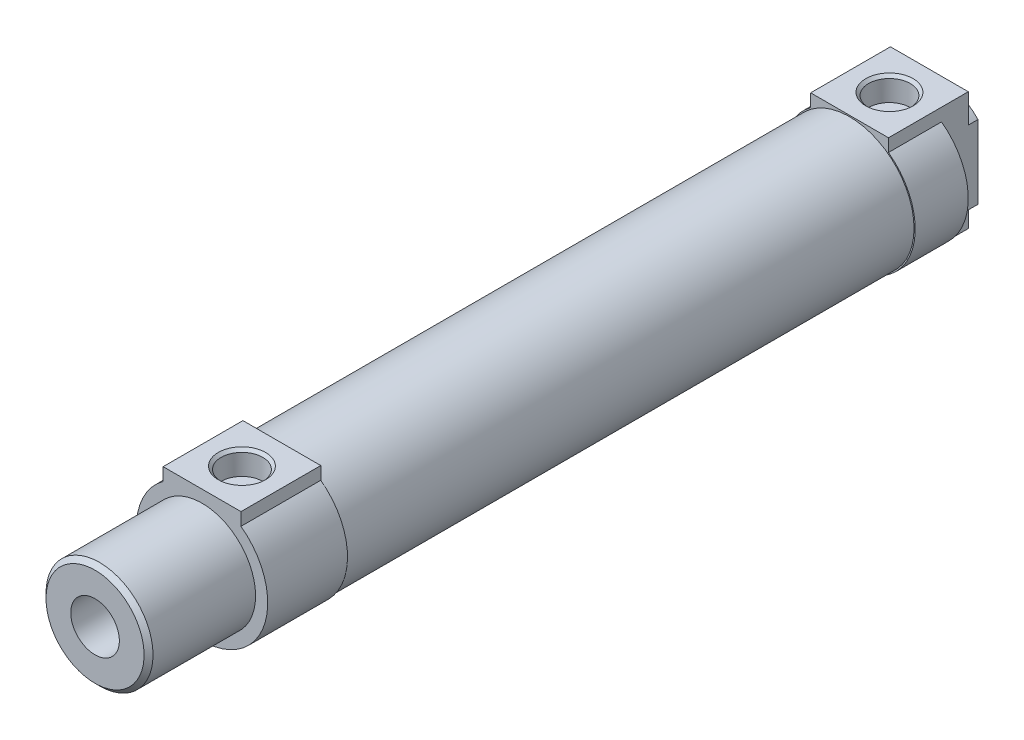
ISO-10303-21;
HEADER;
FILE_DESCRIPTION(('STEP AP214'),'2;1');
FILE_NAME('part.step','',(''),(''),'','','');
FILE_SCHEMA(('AUTOMOTIVE_DESIGN { 1 0 10303 214 1 1 1 1 }'));
ENDSEC;
DATA;
#1=APPLICATION_CONTEXT('core data for automotive mechanical design processes');
#2=APPLICATION_PROTOCOL_DEFINITION('international standard','automotive_design',2000,#1);
#3=PRODUCT_CONTEXT('',#1,'mechanical');
#4=PRODUCT('Part','Part','',(#3));
#5=PRODUCT_RELATED_PRODUCT_CATEGORY('part','',(#4));
#6=PRODUCT_DEFINITION_FORMATION('','',#4);
#7=PRODUCT_DEFINITION_CONTEXT('part definition',#1,'design');
#8=PRODUCT_DEFINITION('design','',#6,#7);
#9=PRODUCT_DEFINITION_SHAPE('','',#8);
#10=(LENGTH_UNIT() NAMED_UNIT(*) SI_UNIT(.MILLI.,.METRE.));
#11=(NAMED_UNIT(*) PLANE_ANGLE_UNIT() SI_UNIT($,.RADIAN.));
#12=(NAMED_UNIT(*) SI_UNIT($,.STERADIAN.) SOLID_ANGLE_UNIT());
#13=UNCERTAINTY_MEASURE_WITH_UNIT(LENGTH_MEASURE(1.E-05),#10,'distance_accuracy_value','');
#14=(GEOMETRIC_REPRESENTATION_CONTEXT(3) GLOBAL_UNCERTAINTY_ASSIGNED_CONTEXT((#13)) GLOBAL_UNIT_ASSIGNED_CONTEXT((#10,
#11,#12)) REPRESENTATION_CONTEXT('',''));
#15=CARTESIAN_POINT('',(0.,0.,0.));
#16=DIRECTION('',(0.,0.,1.));
#17=DIRECTION('',(1.,0.,0.));
#18=AXIS2_PLACEMENT_3D('',#15,#16,#17);
#19=CARTESIAN_POINT('',(0.,0.,-160.04));
#20=DIRECTION('',(0.,0.,1.));
#21=DIRECTION('',(1.,0.,0.));
#22=AXIS2_PLACEMENT_3D('',#19,#20,#21);
#23=CYLINDRICAL_SURFACE('',#22,11.);
#24=DIRECTION('',(0.,0.,1.));
#25=VECTOR('',#24,1.);
#26=CARTESIAN_POINT('',(-7.99999999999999,-7.54983443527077,-144.));
#27=LINE('',#26,#25);
#28=CARTESIAN_POINT('',(-7.99999999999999,-7.54983443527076,-149.5));
#29=VERTEX_POINT('',#28);
#30=CARTESIAN_POINT('',(-7.99999999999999,-7.54983443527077,-151.5));
#31=VERTEX_POINT('',#30);
#32=EDGE_CURVE('E144',#29,#31,#27,.F.);
#33=ORIENTED_EDGE('',*,*,#32,.T.);
#34=CARTESIAN_POINT('',(0.,0.,-151.5));
#35=DIRECTION('',(0.,0.,-1.));
#36=DIRECTION('',(-1.,0.,0.));
#37=AXIS2_PLACEMENT_3D('',#34,#35,#36);
#38=CIRCLE('',#37,11.);
#39=CARTESIAN_POINT('',(8.00000000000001,-7.54983443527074,-151.5));
#40=VERTEX_POINT('',#39);
#41=EDGE_CURVE('E50',#40,#31,#38,.T.);
#42=ORIENTED_EDGE('',*,*,#41,.F.);
#43=DIRECTION('',(0.,0.,1.));
#44=VECTOR('',#43,1.);
#45=CARTESIAN_POINT('',(8.00000000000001,-7.54983443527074,-172.5));
#46=LINE('',#45,#44);
#47=CARTESIAN_POINT('',(8.00000000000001,-7.54983443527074,-149.5));
#48=VERTEX_POINT('',#47);
#49=EDGE_CURVE('E150',#40,#48,#46,.T.);
#50=ORIENTED_EDGE('',*,*,#49,.T.);
#51=CARTESIAN_POINT('',(0.,0.,-149.5));
#52=DIRECTION('',(0.,0.,1.));
#53=DIRECTION('',(1.,0.,0.));
#54=AXIS2_PLACEMENT_3D('',#51,#52,#53);
#55=CIRCLE('',#54,11.);
#56=EDGE_CURVE('E136',#48,#29,#55,.F.);
#57=ORIENTED_EDGE('',*,*,#56,.T.);
#58=EDGE_LOOP('',(#33,#42,#50,#57));
#59=FACE_BOUND('',#58,.T.);
#60=ADVANCED_FACE('F33',(#59),#23,.T.);
#61=CARTESIAN_POINT('',(0.,0.,-160.04));
#62=DIRECTION('',(0.,0.,1.));
#63=DIRECTION('',(1.,0.,0.));
#64=AXIS2_PLACEMENT_3D('',#61,#62,#63);
#65=CYLINDRICAL_SURFACE('',#64,11.);
#66=DIRECTION('',(0.,0.,1.));
#67=VECTOR('',#66,1.);
#68=CARTESIAN_POINT('',(8.00000000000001,7.54983443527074,-172.5));
#69=LINE('',#68,#67);
#70=CARTESIAN_POINT('',(8.00000000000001,7.54983443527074,-149.5));
#71=VERTEX_POINT('',#70);
#72=CARTESIAN_POINT('',(8.00000000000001,7.54983443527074,-151.5));
#73=VERTEX_POINT('',#72);
#74=EDGE_CURVE('E288',#71,#73,#69,.F.);
#75=ORIENTED_EDGE('',*,*,#74,.T.);
#76=CARTESIAN_POINT('',(0.,0.,-151.5));
#77=DIRECTION('',(0.,0.,-1.));
#78=DIRECTION('',(-1.,0.,0.));
#79=AXIS2_PLACEMENT_3D('',#76,#77,#78);
#80=CIRCLE('',#79,11.);
#81=CARTESIAN_POINT('',(-7.99999999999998,7.54983443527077,-151.5));
#82=VERTEX_POINT('',#81);
#83=EDGE_CURVE('E317',#82,#73,#80,.T.);
#84=ORIENTED_EDGE('',*,*,#83,.F.);
#85=DIRECTION('',(0.,0.,1.));
#86=VECTOR('',#85,1.);
#87=CARTESIAN_POINT('',(-7.99999999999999,7.54983443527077,-144.));
#88=LINE('',#87,#86);
#89=CARTESIAN_POINT('',(-7.99999999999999,7.54983443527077,-149.5));
#90=VERTEX_POINT('',#89);
#91=EDGE_CURVE('E157',#82,#90,#88,.T.);
#92=ORIENTED_EDGE('',*,*,#91,.T.);
#93=CARTESIAN_POINT('',(0.,0.,-149.5));
#94=DIRECTION('',(0.,0.,1.));
#95=DIRECTION('',(1.,0.,0.));
#96=AXIS2_PLACEMENT_3D('',#93,#94,#95);
#97=CIRCLE('',#96,11.);
#98=EDGE_CURVE('E151',#71,#90,#97,.T.);
#99=ORIENTED_EDGE('',*,*,#98,.F.);
#100=EDGE_LOOP('',(#75,#84,#92,#99));
#101=FACE_BOUND('',#100,.T.);
#102=ADVANCED_FACE('F329',(#101),#65,.T.);
#103=CARTESIAN_POINT('',(8.00000000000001,27.,-172.5));
#104=DIRECTION('',(-1.,0.,0.));
#105=DIRECTION('',(0.,0.,1.));
#106=AXIS2_PLACEMENT_3D('',#103,#104,#105);
#107=PLANE('',#106);
#108=DIRECTION('',(0.,-1.,0.));
#109=VECTOR('',#108,1.);
#110=CARTESIAN_POINT('',(8.00000000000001,-7.54983443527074,-151.5));
#111=LINE('',#110,#109);
#112=EDGE_CURVE('E314',#73,#40,#111,.T.);
#113=ORIENTED_EDGE('',*,*,#112,.F.);
#114=ORIENTED_EDGE('',*,*,#74,.F.);
#115=DIRECTION('',(0.,1.,0.));
#116=VECTOR('',#115,1.);
#117=CARTESIAN_POINT('',(8.00000000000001,27.,-149.5));
#118=LINE('',#117,#116);
#119=CARTESIAN_POINT('',(8.00000000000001,13.5,-149.5));
#120=VERTEX_POINT('',#119);
#121=EDGE_CURVE('E230',#120,#71,#118,.F.);
#122=ORIENTED_EDGE('',*,*,#121,.F.);
#123=DIRECTION('',(0.,0.,1.));
#124=VECTOR('',#123,1.);
#125=CARTESIAN_POINT('',(8.00000000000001,13.5,0.));
#126=LINE('',#125,#124);
#127=CARTESIAN_POINT('',(8.00000000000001,13.5,-133.1));
#128=VERTEX_POINT('',#127);
#129=EDGE_CURVE('E221',#128,#120,#126,.F.);
#130=ORIENTED_EDGE('',*,*,#129,.F.);
#131=DIRECTION('',(0.,1.,0.));
#132=VECTOR('',#131,1.);
#133=CARTESIAN_POINT('',(8.00000000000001,13.375,-133.1));
#134=LINE('',#133,#132);
#135=CARTESIAN_POINT('',(8.00000000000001,10.8742815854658,-133.1));
#136=VERTEX_POINT('',#135);
#137=EDGE_CURVE('E170',#136,#128,#134,.T.);
#138=ORIENTED_EDGE('',*,*,#137,.F.);
#139=DIRECTION('',(0.,0.,1.));
#140=VECTOR('',#139,1.);
#141=CARTESIAN_POINT('',(8.00000000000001,10.8742815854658,-172.5));
#142=LINE('',#141,#140);
#143=CARTESIAN_POINT('',(8.00000000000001,10.8742815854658,-144.));
#144=VERTEX_POINT('',#143);
#145=EDGE_CURVE('E228',#144,#136,#142,.T.);
#146=ORIENTED_EDGE('',*,*,#145,.F.);
#147=DIRECTION('',(0.,1.,0.));
#148=VECTOR('',#147,1.);
#149=CARTESIAN_POINT('',(8.00000000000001,27.,-144.));
#150=LINE('',#149,#148);
#151=CARTESIAN_POINT('',(8.00000000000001,-10.8742815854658,-144.));
#152=VERTEX_POINT('',#151);
#153=EDGE_CURVE('E231',#152,#144,#150,.T.);
#154=ORIENTED_EDGE('',*,*,#153,.F.);
#155=DIRECTION('',(0.,0.,1.));
#156=VECTOR('',#155,1.);
#157=CARTESIAN_POINT('',(8.00000000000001,-10.8742815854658,-172.5));
#158=LINE('',#157,#156);
#159=CARTESIAN_POINT('',(8.00000000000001,-10.8742815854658,-149.5));
#160=VERTEX_POINT('',#159);
#161=EDGE_CURVE('E259',#160,#152,#158,.T.);
#162=ORIENTED_EDGE('',*,*,#161,.F.);
#163=DIRECTION('',(0.,1.,0.));
#164=VECTOR('',#163,1.);
#165=CARTESIAN_POINT('',(8.00000000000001,27.,-149.5));
#166=LINE('',#165,#164);
#167=EDGE_CURVE('E262',#48,#160,#166,.F.);
#168=ORIENTED_EDGE('',*,*,#167,.F.);
#169=ORIENTED_EDGE('',*,*,#49,.F.);
#170=EDGE_LOOP('',(#113,#114,#122,#130,#138,#146,#154,#162,#168,#169));
#171=FACE_BOUND('',#170,.T.);
#172=ADVANCED_FACE('F332',(#171),#107,.F.);
#173=CARTESIAN_POINT('',(-7.99999999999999,27.,-144.));
#174=DIRECTION('',(1.,0.,0.));
#175=DIRECTION('',(0.,1.,0.));
#176=AXIS2_PLACEMENT_3D('',#173,#174,#175);
#177=PLANE('',#176);
#178=DIRECTION('',(0.,1.,0.));
#179=VECTOR('',#178,1.);
#180=CARTESIAN_POINT('',(-7.99999999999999,7.54983443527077,-151.5));
#181=LINE('',#180,#179);
#182=EDGE_CURVE('E156',#31,#82,#181,.T.);
#183=ORIENTED_EDGE('',*,*,#182,.F.);
#184=ORIENTED_EDGE('',*,*,#32,.F.);
#185=DIRECTION('',(0.,1.,0.));
#186=VECTOR('',#185,1.);
#187=CARTESIAN_POINT('',(-7.99999999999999,27.,-149.5));
#188=LINE('',#187,#186);
#189=CARTESIAN_POINT('',(-7.99999999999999,-10.8742815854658,-149.5));
#190=VERTEX_POINT('',#189);
#191=EDGE_CURVE('E133',#190,#29,#188,.T.);
#192=ORIENTED_EDGE('',*,*,#191,.F.);
#193=DIRECTION('',(0.,0.,1.));
#194=VECTOR('',#193,1.);
#195=CARTESIAN_POINT('',(-7.99999999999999,-10.8742815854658,-144.));
#196=LINE('',#195,#194);
#197=CARTESIAN_POINT('',(-7.99999999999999,-10.8742815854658,-144.));
#198=VERTEX_POINT('',#197);
#199=EDGE_CURVE('E145',#198,#190,#196,.F.);
#200=ORIENTED_EDGE('',*,*,#199,.F.);
#201=DIRECTION('',(0.,1.,0.));
#202=VECTOR('',#201,1.);
#203=CARTESIAN_POINT('',(-7.99999999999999,27.,-144.));
#204=LINE('',#203,#202);
#205=CARTESIAN_POINT('',(-7.99999999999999,10.8742815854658,-144.));
#206=VERTEX_POINT('',#205);
#207=EDGE_CURVE('E212',#206,#198,#204,.F.);
#208=ORIENTED_EDGE('',*,*,#207,.F.);
#209=DIRECTION('',(0.,0.,1.));
#210=VECTOR('',#209,1.);
#211=CARTESIAN_POINT('',(-7.99999999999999,10.8742815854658,-144.));
#212=LINE('',#211,#210);
#213=CARTESIAN_POINT('',(-7.99999999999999,10.8742815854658,-133.1));
#214=VERTEX_POINT('',#213);
#215=EDGE_CURVE('E209',#214,#206,#212,.F.);
#216=ORIENTED_EDGE('',*,*,#215,.F.);
#217=DIRECTION('',(0.,1.,0.));
#218=VECTOR('',#217,1.);
#219=CARTESIAN_POINT('',(-7.99999999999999,13.375,-133.1));
#220=LINE('',#219,#218);
#221=CARTESIAN_POINT('',(-7.99999999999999,13.5,-133.1));
#222=VERTEX_POINT('',#221);
#223=EDGE_CURVE('E163',#222,#214,#220,.F.);
#224=ORIENTED_EDGE('',*,*,#223,.F.);
#225=DIRECTION('',(0.,0.,1.));
#226=VECTOR('',#225,1.);
#227=CARTESIAN_POINT('',(-7.99999999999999,13.5,-144.));
#228=LINE('',#227,#226);
#229=CARTESIAN_POINT('',(-7.99999999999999,13.5,-149.5));
#230=VERTEX_POINT('',#229);
#231=EDGE_CURVE('E213',#230,#222,#228,.T.);
#232=ORIENTED_EDGE('',*,*,#231,.F.);
#233=DIRECTION('',(0.,1.,0.));
#234=VECTOR('',#233,1.);
#235=CARTESIAN_POINT('',(-7.99999999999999,27.,-149.5));
#236=LINE('',#235,#234);
#237=EDGE_CURVE('E159',#90,#230,#236,.T.);
#238=ORIENTED_EDGE('',*,*,#237,.F.);
#239=ORIENTED_EDGE('',*,*,#91,.F.);
#240=EDGE_LOOP('',(#183,#184,#192,#200,#208,#216,#224,#232,#238,#239));
#241=FACE_BOUND('',#240,.T.);
#242=ADVANCED_FACE('F154',(#241),#177,.F.);
#243=CARTESIAN_POINT('',(0.,6.25,-127.5));
#244=DIRECTION('',(0.,0.,-1.));
#245=DIRECTION('',(-1.,0.,0.));
#246=AXIS2_PLACEMENT_3D('',#243,#244,#245);
#247=PLANE('',#246);
#248=CARTESIAN_POINT('',(0.,0.,-127.5));
#249=DIRECTION('',(0.,0.,1.));
#250=DIRECTION('',(1.,0.,0.));
#251=AXIS2_PLACEMENT_3D('',#248,#249,#250);
#252=CIRCLE('',#251,12.5);
#253=CARTESIAN_POINT('',(12.5,0.,-127.5));
#254=VERTEX_POINT('',#253);
#255=EDGE_CURVE('E37',#254,#254,#252,.T.);
#256=ORIENTED_EDGE('',*,*,#255,.T.);
#257=EDGE_LOOP('',(#256));
#258=FACE_BOUND('',#257,.T.);
#259=ADVANCED_FACE('F418',(#258),#247,.F.);
#260=CARTESIAN_POINT('',(0.,0.,-84.375));
#261=DIRECTION('',(0.,0.,1.));
#262=DIRECTION('',(1.,0.,0.));
#263=AXIS2_PLACEMENT_3D('',#260,#261,#262);
#264=CYLINDRICAL_SURFACE('',#263,12.5);
#265=CARTESIAN_POINT('',(0.,0.,-41.25));
#266=DIRECTION('',(0.,0.,1.));
#267=DIRECTION('',(1.,0.,0.));
#268=AXIS2_PLACEMENT_3D('',#265,#266,#267);
#269=CIRCLE('',#268,12.5);
#270=CARTESIAN_POINT('',(12.5,0.,-41.25));
#271=VERTEX_POINT('',#270);
#272=EDGE_CURVE('E309',#271,#271,#269,.T.);
#273=ORIENTED_EDGE('',*,*,#272,.T.);
#274=EDGE_LOOP('',(#273));
#275=FACE_BOUND('',#274,.T.);
#276=ORIENTED_EDGE('',*,*,#255,.F.);
#277=EDGE_LOOP('',(#276));
#278=FACE_BOUND('',#277,.T.);
#279=ADVANCED_FACE('F414',(#275,#278),#264,.F.);
#280=CARTESIAN_POINT('',(0.,8.75,-41.25));
#281=DIRECTION('',(0.,0.,1.));
#282=DIRECTION('',(0.,-1.,0.));
#283=AXIS2_PLACEMENT_3D('',#280,#281,#282);
#284=PLANE('',#283);
#285=ORIENTED_EDGE('',*,*,#272,.F.);
#286=EDGE_LOOP('',(#285));
#287=FACE_BOUND('',#286,.T.);
#288=CARTESIAN_POINT('',(0.,0.,-41.25));
#289=DIRECTION('',(0.,0.,1.));
#290=DIRECTION('',(1.,0.,0.));
#291=AXIS2_PLACEMENT_3D('',#288,#289,#290);
#292=CIRCLE('',#291,5.);
#293=CARTESIAN_POINT('',(5.,0.,-41.25));
#294=VERTEX_POINT('',#293);
#295=EDGE_CURVE('E307',#294,#294,#292,.T.);
#296=ORIENTED_EDGE('',*,*,#295,.T.);
#297=EDGE_LOOP('',(#296));
#298=FACE_BOUND('',#297,.T.);
#299=ADVANCED_FACE('F410',(#287,#298),#284,.F.);
#300=CARTESIAN_POINT('',(0.,0.,-9.62500000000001));
#301=DIRECTION('',(0.,0.,1.));
#302=DIRECTION('',(1.,0.,0.));
#303=AXIS2_PLACEMENT_3D('',#300,#301,#302);
#304=CYLINDRICAL_SURFACE('',#303,5.);
#305=CARTESIAN_POINT('',(0.,0.,22.));
#306=DIRECTION('',(0.,0.,1.));
#307=DIRECTION('',(1.,0.,0.));
#308=AXIS2_PLACEMENT_3D('',#305,#306,#307);
#309=CIRCLE('',#308,5.);
#310=CARTESIAN_POINT('',(5.,0.,22.));
#311=VERTEX_POINT('',#310);
#312=EDGE_CURVE('E304',#311,#311,#309,.F.);
#313=ORIENTED_EDGE('',*,*,#312,.F.);
#314=EDGE_LOOP('',(#313));
#315=FACE_BOUND('',#314,.T.);
#316=ORIENTED_EDGE('',*,*,#295,.F.);
#317=EDGE_LOOP('',(#316));
#318=FACE_BOUND('',#317,.T.);
#319=ADVANCED_FACE('F406',(#315,#318),#304,.F.);
#320=CARTESIAN_POINT('',(0.,5.04,22.));
#321=DIRECTION('',(0.,0.,1.));
#322=DIRECTION('',(1.,0.,0.));
#323=AXIS2_PLACEMENT_3D('',#320,#321,#322);
#324=PLANE('',#323);
#325=CARTESIAN_POINT('',(0.,0.,22.));
#326=DIRECTION('',(0.,0.,-1.));
#327=DIRECTION('',(-1.,0.,0.));
#328=AXIS2_PLACEMENT_3D('',#325,#326,#327);
#329=CIRCLE('',#328,10.08);
#330=CARTESIAN_POINT('',(-10.08,0.,22.));
#331=VERTEX_POINT('',#330);
#332=EDGE_CURVE('E301',#331,#331,#329,.T.);
#333=ORIENTED_EDGE('',*,*,#332,.F.);
#334=EDGE_LOOP('',(#333));
#335=FACE_BOUND('',#334,.T.);
#336=ORIENTED_EDGE('',*,*,#312,.T.);
#337=EDGE_LOOP('',(#336));
#338=FACE_BOUND('',#337,.T.);
#339=ADVANCED_FACE('F402',(#335,#338),#324,.T.);
#340=CARTESIAN_POINT('',(0.,8.636,-143.4415));
#341=DIRECTION('',(0.,-1.,0.));
#342=DIRECTION('',(0.,0.,-1.));
#343=AXIS2_PLACEMENT_3D('',#340,#341,#342);
#344=PLANE('',#343);
#345=CARTESIAN_POINT('',(0.,8.636,-141.3));
#346=DIRECTION('',(0.,1.,0.));
#347=DIRECTION('',(0.,0.,1.));
#348=AXIS2_PLACEMENT_3D('',#345,#346,#347);
#349=CIRCLE('',#348,4.28299999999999);
#350=CARTESIAN_POINT('',(0.,8.636,-137.017));
#351=VERTEX_POINT('',#350);
#352=EDGE_CURVE('E298',#351,#351,#349,.T.);
#353=ORIENTED_EDGE('',*,*,#352,.T.);
#354=EDGE_LOOP('',(#353));
#355=FACE_BOUND('',#354,.T.);
#356=ADVANCED_FACE('F398',(#355),#344,.F.);
#357=CARTESIAN_POINT('',(0.,8.636,-10.3415));
#358=DIRECTION('',(0.,-1.,0.));
#359=DIRECTION('',(0.,0.,-1.));
#360=AXIS2_PLACEMENT_3D('',#357,#358,#359);
#361=PLANE('',#360);
#362=CARTESIAN_POINT('',(0.,8.636,-8.2));
#363=DIRECTION('',(0.,1.,0.));
#364=DIRECTION('',(0.,0.,1.));
#365=AXIS2_PLACEMENT_3D('',#362,#363,#364);
#366=CIRCLE('',#365,4.283);
#367=CARTESIAN_POINT('',(0.,8.636,-3.917));
#368=VERTEX_POINT('',#367);
#369=EDGE_CURVE('E272',#368,#368,#366,.T.);
#370=ORIENTED_EDGE('',*,*,#369,.T.);
#371=EDGE_LOOP('',(#370));
#372=FACE_BOUND('',#371,.T.);
#373=ADVANCED_FACE('F394',(#372),#361,.F.);
#374=CARTESIAN_POINT('',(0.,0.,21.08));
#375=DIRECTION('',(0.,0.,-1.));
#376=DIRECTION('',(-1.,0.,0.));
#377=AXIS2_PLACEMENT_3D('',#374,#375,#376);
#378=CONICAL_SURFACE('',#377,11.,0.785398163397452);
#379=ORIENTED_EDGE('',*,*,#332,.T.);
#380=EDGE_LOOP('',(#379));
#381=FACE_BOUND('',#380,.T.);
#382=CARTESIAN_POINT('',(0.,0.,21.08));
#383=DIRECTION('',(0.,0.,1.));
#384=DIRECTION('',(1.,0.,0.));
#385=AXIS2_PLACEMENT_3D('',#382,#383,#384);
#386=CIRCLE('',#385,11.);
#387=CARTESIAN_POINT('',(11.,0.,21.08));
#388=VERTEX_POINT('',#387);
#389=EDGE_CURVE('E270',#388,#388,#386,.F.);
#390=ORIENTED_EDGE('',*,*,#389,.F.);
#391=EDGE_LOOP('',(#390));
#392=FACE_BOUND('',#391,.T.);
#393=ADVANCED_FACE('F390',(#381,#392),#378,.T.);
#394=CARTESIAN_POINT('',(0.,10.7775,-141.3));
#395=DIRECTION('',(0.,1.,0.));
#396=DIRECTION('',(0.,0.,1.));
#397=AXIS2_PLACEMENT_3D('',#394,#395,#396);
#398=CYLINDRICAL_SURFACE('',#397,4.28299999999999);
#399=CARTESIAN_POINT('',(0.,12.9190000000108,-141.3));
#400=DIRECTION('',(0.,1.,0.));
#401=DIRECTION('',(0.,0.,-1.));
#402=AXIS2_PLACEMENT_3D('',#399,#400,#401);
#403=CIRCLE('',#402,4.2829999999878);
#404=CARTESIAN_POINT('',(0.,12.9190000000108,-145.582999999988));
#405=VERTEX_POINT('',#404);
#406=EDGE_CURVE('E152',#405,#405,#403,.T.);
#407=ORIENTED_EDGE('',*,*,#406,.T.);
#408=EDGE_LOOP('',(#407));
#409=FACE_BOUND('',#408,.T.);
#410=ORIENTED_EDGE('',*,*,#352,.F.);
#411=EDGE_LOOP('',(#410));
#412=FACE_BOUND('',#411,.T.);
#413=ADVANCED_FACE('F386',(#409,#412),#398,.F.);
#414=CARTESIAN_POINT('',(0.,10.7775,-8.2));
#415=DIRECTION('',(0.,1.,0.));
#416=DIRECTION('',(0.,0.,1.));
#417=AXIS2_PLACEMENT_3D('',#414,#415,#416);
#418=CYLINDRICAL_SURFACE('',#417,4.283);
#419=CARTESIAN_POINT('',(0.,12.9190000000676,-8.2));
#420=DIRECTION('',(0.,1.,0.));
#421=DIRECTION('',(0.,0.,-1.));
#422=AXIS2_PLACEMENT_3D('',#419,#420,#421);
#423=CIRCLE('',#422,4.28300000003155);
#424=CARTESIAN_POINT('',(0.,12.9190000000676,-12.4830000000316));
#425=VERTEX_POINT('',#424);
#426=EDGE_CURVE('E264',#425,#425,#423,.T.);
#427=ORIENTED_EDGE('',*,*,#426,.T.);
#428=EDGE_LOOP('',(#427));
#429=FACE_BOUND('',#428,.T.);
#430=ORIENTED_EDGE('',*,*,#369,.F.);
#431=EDGE_LOOP('',(#430));
#432=FACE_BOUND('',#431,.T.);
#433=ADVANCED_FACE('F382',(#429,#432),#418,.F.);
#434=CARTESIAN_POINT('',(0.,0.,10.54));
#435=DIRECTION('',(0.,0.,1.));
#436=DIRECTION('',(1.,0.,0.));
#437=AXIS2_PLACEMENT_3D('',#434,#435,#436);
#438=CYLINDRICAL_SURFACE('',#437,11.);
#439=ORIENTED_EDGE('',*,*,#389,.T.);
#440=EDGE_LOOP('',(#439));
#441=FACE_BOUND('',#440,.T.);
#442=CARTESIAN_POINT('',(0.,0.,0.));
#443=DIRECTION('',(0.,0.,1.));
#444=DIRECTION('',(1.,0.,0.));
#445=AXIS2_PLACEMENT_3D('',#442,#443,#444);
#446=CIRCLE('',#445,11.);
#447=CARTESIAN_POINT('',(11.,0.,0.));
#448=VERTEX_POINT('',#447);
#449=EDGE_CURVE('E267',#448,#448,#446,.F.);
#450=ORIENTED_EDGE('',*,*,#449,.F.);
#451=EDGE_LOOP('',(#450));
#452=FACE_BOUND('',#451,.T.);
#453=ADVANCED_FACE('F378',(#441,#452),#438,.T.);
#454=CARTESIAN_POINT('',(8.00000000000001,27.,-144.));
#455=DIRECTION('',(0.,0.,1.));
#456=DIRECTION('',(1.,0.,0.));
#457=AXIS2_PLACEMENT_3D('',#454,#455,#456);
#458=PLANE('',#457);
#459=ORIENTED_EDGE('',*,*,#153,.T.);
#460=CARTESIAN_POINT('',(0.,0.,-144.));
#461=DIRECTION('',(0.,0.,1.));
#462=DIRECTION('',(1.,0.,0.));
#463=AXIS2_PLACEMENT_3D('',#460,#461,#462);
#464=CIRCLE('',#463,13.5);
#465=EDGE_CURVE('E285',#152,#144,#464,.T.);
#466=ORIENTED_EDGE('',*,*,#465,.F.);
#467=EDGE_LOOP('',(#459,#466));
#468=FACE_BOUND('',#467,.T.);
#469=ADVANCED_FACE('F374',(#468),#458,.F.);
#470=CARTESIAN_POINT('',(0.,13.5000000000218,-141.3));
#471=DIRECTION('',(0.,1.,0.));
#472=DIRECTION('',(0.,0.,1.));
#473=AXIS2_PLACEMENT_3D('',#470,#471,#472);
#474=CONICAL_SURFACE('',#473,4.86399999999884,0.785398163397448);
#475=CARTESIAN_POINT('',(0.,13.5000000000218,-141.3));
#476=DIRECTION('',(0.,1.,0.));
#477=DIRECTION('',(0.,0.,1.));
#478=AXIS2_PLACEMENT_3D('',#475,#476,#477);
#479=CIRCLE('',#478,4.86399999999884);
#480=CARTESIAN_POINT('',(0.,13.5000000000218,-136.436000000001));
#481=VERTEX_POINT('',#480);
#482=EDGE_CURVE('E225',#481,#481,#479,.F.);
#483=ORIENTED_EDGE('',*,*,#482,.F.);
#484=EDGE_LOOP('',(#483));
#485=FACE_BOUND('',#484,.T.);
#486=ORIENTED_EDGE('',*,*,#406,.F.);
#487=EDGE_LOOP('',(#486));
#488=FACE_BOUND('',#487,.T.);
#489=ADVANCED_FACE('F363',(#485,#488),#474,.F.);
#490=CARTESIAN_POINT('',(0.,12.25,-149.5));
#491=DIRECTION('',(0.,0.,-1.));
#492=DIRECTION('',(-1.,0.,0.));
#493=AXIS2_PLACEMENT_3D('',#490,#491,#492);
#494=PLANE('',#493);
#495=ORIENTED_EDGE('',*,*,#167,.T.);
#496=CARTESIAN_POINT('',(0.,0.,-149.5));
#497=DIRECTION('',(0.,0.,1.));
#498=DIRECTION('',(1.,0.,0.));
#499=AXIS2_PLACEMENT_3D('',#496,#497,#498);
#500=CIRCLE('',#499,13.5);
#501=EDGE_CURVE('E139',#190,#160,#500,.T.);
#502=ORIENTED_EDGE('',*,*,#501,.F.);
#503=ORIENTED_EDGE('',*,*,#191,.T.);
#504=ORIENTED_EDGE('',*,*,#56,.F.);
#505=EDGE_LOOP('',(#495,#502,#503,#504));
#506=FACE_BOUND('',#505,.T.);
#507=ADVANCED_FACE('F135',(#506),#494,.T.);
#508=CARTESIAN_POINT('',(0.,12.25,-149.5));
#509=DIRECTION('',(0.,0.,-1.));
#510=DIRECTION('',(-1.,0.,0.));
#511=AXIS2_PLACEMENT_3D('',#508,#509,#510);
#512=PLANE('',#511);
#513=ORIENTED_EDGE('',*,*,#121,.T.);
#514=ORIENTED_EDGE('',*,*,#98,.T.);
#515=ORIENTED_EDGE('',*,*,#237,.T.);
#516=DIRECTION('',(1.,0.,0.));
#517=VECTOR('',#516,1.);
#518=CARTESIAN_POINT('',(0.,13.5,-149.5));
#519=LINE('',#518,#517);
#520=EDGE_CURVE('E224',#120,#230,#519,.F.);
#521=ORIENTED_EDGE('',*,*,#520,.F.);
#522=EDGE_LOOP('',(#513,#514,#515,#521));
#523=FACE_BOUND('',#522,.T.);
#524=ADVANCED_FACE('F354',(#523),#512,.T.);
#525=CARTESIAN_POINT('',(-35.,27.,-144.));
#526=DIRECTION('',(0.,0.,1.));
#527=DIRECTION('',(1.,0.,0.));
#528=AXIS2_PLACEMENT_3D('',#525,#526,#527);
#529=PLANE('',#528);
#530=ORIENTED_EDGE('',*,*,#207,.T.);
#531=CARTESIAN_POINT('',(0.,0.,-144.));
#532=DIRECTION('',(0.,0.,1.));
#533=DIRECTION('',(1.,0.,0.));
#534=AXIS2_PLACEMENT_3D('',#531,#532,#533);
#535=CIRCLE('',#534,13.5);
#536=EDGE_CURVE('E290',#206,#198,#535,.T.);
#537=ORIENTED_EDGE('',*,*,#536,.F.);
#538=EDGE_LOOP('',(#530,#537));
#539=FACE_BOUND('',#538,.T.);
#540=ADVANCED_FACE('F342',(#539),#529,.F.);
#541=CARTESIAN_POINT('',(0.,13.4999999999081,-8.2));
#542=DIRECTION('',(0.,1.,0.));
#543=DIRECTION('',(0.,0.,1.));
#544=AXIS2_PLACEMENT_3D('',#541,#542,#543);
#545=CONICAL_SURFACE('',#544,4.86399999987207,0.785398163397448);
#546=CARTESIAN_POINT('',(0.,13.499999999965,-8.2));
#547=DIRECTION('',(0.,1.,0.));
#548=DIRECTION('',(0.,0.,1.));
#549=AXIS2_PLACEMENT_3D('',#546,#547,#548);
#550=CIRCLE('',#549,4.86399999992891);
#551=CARTESIAN_POINT('',(0.,13.499999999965,-3.33600000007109));
#552=VERTEX_POINT('',#551);
#553=EDGE_CURVE('E237',#552,#552,#550,.F.);
#554=ORIENTED_EDGE('',*,*,#553,.F.);
#555=EDGE_LOOP('',(#554));
#556=FACE_BOUND('',#555,.T.);
#557=ORIENTED_EDGE('',*,*,#426,.F.);
#558=EDGE_LOOP('',(#557));
#559=FACE_BOUND('',#558,.T.);
#560=ADVANCED_FACE('F361',(#556,#559),#545,.F.);
#561=CARTESIAN_POINT('',(0.,12.25,0.));
#562=DIRECTION('',(0.,0.,1.));
#563=DIRECTION('',(1.,0.,0.));
#564=AXIS2_PLACEMENT_3D('',#561,#562,#563);
#565=PLANE('',#564);
#566=CARTESIAN_POINT('',(0.,0.,0.));
#567=DIRECTION('',(0.,0.,1.));
#568=DIRECTION('',(1.,0.,0.));
#569=AXIS2_PLACEMENT_3D('',#566,#567,#568);
#570=CIRCLE('',#569,13.5);
#571=CARTESIAN_POINT('',(8.,10.8742815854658,0.));
#572=VERTEX_POINT('',#571);
#573=CARTESIAN_POINT('',(-8.,10.8742815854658,0.));
#574=VERTEX_POINT('',#573);
#575=EDGE_CURVE('E208',#572,#574,#570,.F.);
#576=ORIENTED_EDGE('',*,*,#575,.F.);
#577=DIRECTION('',(0.,1.,0.));
#578=VECTOR('',#577,1.);
#579=CARTESIAN_POINT('',(8.,0.,0.));
#580=LINE('',#579,#578);
#581=CARTESIAN_POINT('',(8.,13.5,0.));
#582=VERTEX_POINT('',#581);
#583=EDGE_CURVE('E192',#582,#572,#580,.F.);
#584=ORIENTED_EDGE('',*,*,#583,.F.);
#585=DIRECTION('',(1.,0.,0.));
#586=VECTOR('',#585,1.);
#587=CARTESIAN_POINT('',(0.,13.5,0.));
#588=LINE('',#587,#586);
#589=CARTESIAN_POINT('',(-8.,13.5,0.));
#590=VERTEX_POINT('',#589);
#591=EDGE_CURVE('E201',#590,#582,#588,.T.);
#592=ORIENTED_EDGE('',*,*,#591,.F.);
#593=DIRECTION('',(0.,1.,0.));
#594=VECTOR('',#593,1.);
#595=CARTESIAN_POINT('',(-8.,0.,0.));
#596=LINE('',#595,#594);
#597=EDGE_CURVE('E207',#574,#590,#596,.T.);
#598=ORIENTED_EDGE('',*,*,#597,.F.);
#599=EDGE_LOOP('',(#576,#584,#592,#598));
#600=FACE_BOUND('',#599,.T.);
#601=ORIENTED_EDGE('',*,*,#449,.T.);
#602=EDGE_LOOP('',(#601));
#603=FACE_BOUND('',#602,.T.);
#604=ADVANCED_FACE('F563',(#600,#603),#565,.T.);
#605=CARTESIAN_POINT('',(0.,0.,-141.3));
#606=DIRECTION('',(0.,0.,1.));
#607=DIRECTION('',(1.,0.,0.));
#608=AXIS2_PLACEMENT_3D('',#605,#606,#607);
#609=CYLINDRICAL_SURFACE('',#608,13.5);
#610=ORIENTED_EDGE('',*,*,#145,.T.);
#611=CARTESIAN_POINT('',(0.,0.,-133.1));
#612=DIRECTION('',(0.,0.,1.));
#613=DIRECTION('',(1.,0.,0.));
#614=AXIS2_PLACEMENT_3D('',#611,#612,#613);
#615=CIRCLE('',#614,13.5);
#616=EDGE_CURVE('E173',#214,#136,#615,.T.);
#617=ORIENTED_EDGE('',*,*,#616,.F.);
#618=ORIENTED_EDGE('',*,*,#215,.T.);
#619=ORIENTED_EDGE('',*,*,#536,.T.);
#620=ORIENTED_EDGE('',*,*,#199,.T.);
#621=ORIENTED_EDGE('',*,*,#501,.T.);
#622=ORIENTED_EDGE('',*,*,#161,.T.);
#623=ORIENTED_EDGE('',*,*,#465,.T.);
#624=EDGE_LOOP('',(#610,#617,#618,#619,#620,#621,#622,#623));
#625=FACE_BOUND('',#624,.T.);
#626=ADVANCED_FACE('F337',(#625),#609,.T.);
#627=CARTESIAN_POINT('',(0.,13.5,0.));
#628=DIRECTION('',(0.,1.,0.));
#629=DIRECTION('',(0.,0.,1.));
#630=AXIS2_PLACEMENT_3D('',#627,#628,#629);
#631=PLANE('',#630);
#632=ORIENTED_EDGE('',*,*,#520,.T.);
#633=ORIENTED_EDGE('',*,*,#231,.T.);
#634=DIRECTION('',(1.,0.,0.));
#635=VECTOR('',#634,1.);
#636=CARTESIAN_POINT('',(0.,13.5,-133.1));
#637=LINE('',#636,#635);
#638=EDGE_CURVE('E167',#128,#222,#637,.F.);
#639=ORIENTED_EDGE('',*,*,#638,.F.);
#640=ORIENTED_EDGE('',*,*,#129,.T.);
#641=EDGE_LOOP('',(#632,#633,#639,#640));
#642=FACE_BOUND('',#641,.T.);
#643=ORIENTED_EDGE('',*,*,#482,.T.);
#644=EDGE_LOOP('',(#643));
#645=FACE_BOUND('',#644,.T.);
#646=ADVANCED_FACE('F351',(#642,#645),#631,.T.);
#647=CARTESIAN_POINT('',(0.,0.,-8.2));
#648=DIRECTION('',(0.,0.,1.));
#649=DIRECTION('',(1.,0.,0.));
#650=AXIS2_PLACEMENT_3D('',#647,#648,#649);
#651=CYLINDRICAL_SURFACE('',#650,13.5);
#652=DIRECTION('',(0.,0.,1.));
#653=VECTOR('',#652,1.);
#654=CARTESIAN_POINT('',(-8.,10.8742815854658,0.));
#655=LINE('',#654,#653);
#656=CARTESIAN_POINT('',(-8.,10.8742815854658,-16.4));
#657=VERTEX_POINT('',#656);
#658=EDGE_CURVE('E204',#657,#574,#655,.T.);
#659=ORIENTED_EDGE('',*,*,#658,.F.);
#660=CARTESIAN_POINT('',(0.,0.,-16.4));
#661=DIRECTION('',(0.,0.,1.));
#662=DIRECTION('',(1.,0.,0.));
#663=AXIS2_PLACEMENT_3D('',#660,#661,#662);
#664=CIRCLE('',#663,13.5);
#665=CARTESIAN_POINT('',(8.,10.8742815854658,-16.4));
#666=VERTEX_POINT('',#665);
#667=EDGE_CURVE('E166',#666,#657,#664,.F.);
#668=ORIENTED_EDGE('',*,*,#667,.F.);
#669=DIRECTION('',(0.,0.,1.));
#670=VECTOR('',#669,1.);
#671=CARTESIAN_POINT('',(8.,10.8742815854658,-16.4));
#672=LINE('',#671,#670);
#673=EDGE_CURVE('E187',#572,#666,#672,.F.);
#674=ORIENTED_EDGE('',*,*,#673,.F.);
#675=ORIENTED_EDGE('',*,*,#575,.T.);
#676=EDGE_LOOP('',(#659,#668,#674,#675));
#677=FACE_BOUND('',#676,.T.);
#678=ADVANCED_FACE('F441',(#677),#651,.T.);
#679=CARTESIAN_POINT('',(-8.,0.,0.));
#680=DIRECTION('',(-1.,0.,0.));
#681=DIRECTION('',(0.,0.,1.));
#682=AXIS2_PLACEMENT_3D('',#679,#680,#681);
#683=PLANE('',#682);
#684=DIRECTION('',(0.,0.,1.));
#685=VECTOR('',#684,1.);
#686=CARTESIAN_POINT('',(-8.,13.5,0.));
#687=LINE('',#686,#685);
#688=CARTESIAN_POINT('',(-8.,13.5,-16.4));
#689=VERTEX_POINT('',#688);
#690=EDGE_CURVE('E190',#689,#590,#687,.T.);
#691=ORIENTED_EDGE('',*,*,#690,.F.);
#692=DIRECTION('',(0.,1.,0.));
#693=VECTOR('',#692,1.);
#694=CARTESIAN_POINT('',(-8.,13.375,-16.4));
#695=LINE('',#694,#693);
#696=EDGE_CURVE('E182',#657,#689,#695,.T.);
#697=ORIENTED_EDGE('',*,*,#696,.F.);
#698=ORIENTED_EDGE('',*,*,#658,.T.);
#699=ORIENTED_EDGE('',*,*,#597,.T.);
#700=EDGE_LOOP('',(#691,#697,#698,#699));
#701=FACE_BOUND('',#700,.T.);
#702=ADVANCED_FACE('F444',(#701),#683,.T.);
#703=CARTESIAN_POINT('',(0.,13.5,0.));
#704=DIRECTION('',(0.,1.,0.));
#705=DIRECTION('',(0.,0.,1.));
#706=AXIS2_PLACEMENT_3D('',#703,#704,#705);
#707=PLANE('',#706);
#708=DIRECTION('',(-1.,0.,0.));
#709=VECTOR('',#708,1.);
#710=CARTESIAN_POINT('',(0.,13.5,-16.4));
#711=LINE('',#710,#709);
#712=CARTESIAN_POINT('',(8.,13.5,-16.4));
#713=VERTEX_POINT('',#712);
#714=EDGE_CURVE('E179',#689,#713,#711,.F.);
#715=ORIENTED_EDGE('',*,*,#714,.F.);
#716=ORIENTED_EDGE('',*,*,#690,.T.);
#717=ORIENTED_EDGE('',*,*,#591,.T.);
#718=DIRECTION('',(0.,0.,1.));
#719=VECTOR('',#718,1.);
#720=CARTESIAN_POINT('',(8.,13.5,-16.4));
#721=LINE('',#720,#719);
#722=EDGE_CURVE('E59',#713,#582,#721,.T.);
#723=ORIENTED_EDGE('',*,*,#722,.F.);
#724=EDGE_LOOP('',(#715,#716,#717,#723));
#725=FACE_BOUND('',#724,.T.);
#726=ORIENTED_EDGE('',*,*,#553,.T.);
#727=EDGE_LOOP('',(#726));
#728=FACE_BOUND('',#727,.T.);
#729=ADVANCED_FACE('F448',(#725,#728),#707,.T.);
#730=CARTESIAN_POINT('',(8.,0.,-16.4));
#731=DIRECTION('',(1.,0.,0.));
#732=DIRECTION('',(0.,1.,0.));
#733=AXIS2_PLACEMENT_3D('',#730,#731,#732);
#734=PLANE('',#733);
#735=ORIENTED_EDGE('',*,*,#722,.T.);
#736=ORIENTED_EDGE('',*,*,#583,.T.);
#737=ORIENTED_EDGE('',*,*,#673,.T.);
#738=DIRECTION('',(0.,1.,0.));
#739=VECTOR('',#738,1.);
#740=CARTESIAN_POINT('',(8.,13.375,-16.4));
#741=LINE('',#740,#739);
#742=EDGE_CURVE('E176',#713,#666,#741,.F.);
#743=ORIENTED_EDGE('',*,*,#742,.F.);
#744=EDGE_LOOP('',(#735,#736,#737,#743));
#745=FACE_BOUND('',#744,.T.);
#746=ADVANCED_FACE('F452',(#745),#734,.T.);
#747=CARTESIAN_POINT('',(0.,13.375,-133.1));
#748=DIRECTION('',(0.,0.,1.));
#749=DIRECTION('',(1.,0.,0.));
#750=AXIS2_PLACEMENT_3D('',#747,#748,#749);
#751=PLANE('',#750);
#752=CARTESIAN_POINT('',(0.,0.,-133.1));
#753=DIRECTION('',(0.,0.,1.));
#754=DIRECTION('',(1.,0.,0.));
#755=AXIS2_PLACEMENT_3D('',#752,#753,#754);
#756=CIRCLE('',#755,13.25);
#757=CARTESIAN_POINT('',(13.25,0.,-133.1));
#758=VERTEX_POINT('',#757);
#759=EDGE_CURVE('E42',#758,#758,#756,.T.);
#760=ORIENTED_EDGE('',*,*,#759,.F.);
#761=EDGE_LOOP('',(#760));
#762=FACE_BOUND('',#761,.T.);
#763=ORIENTED_EDGE('',*,*,#638,.T.);
#764=ORIENTED_EDGE('',*,*,#223,.T.);
#765=ORIENTED_EDGE('',*,*,#616,.T.);
#766=ORIENTED_EDGE('',*,*,#137,.T.);
#767=EDGE_LOOP('',(#763,#764,#765,#766));
#768=FACE_BOUND('',#767,.T.);
#769=ADVANCED_FACE('F346',(#762,#768),#751,.T.);
#770=CARTESIAN_POINT('',(0.,13.375,-16.4));
#771=DIRECTION('',(0.,0.,-1.));
#772=DIRECTION('',(-1.,0.,0.));
#773=AXIS2_PLACEMENT_3D('',#770,#771,#772);
#774=PLANE('',#773);
#775=CARTESIAN_POINT('',(0.,0.,-16.4));
#776=DIRECTION('',(0.,0.,1.));
#777=DIRECTION('',(1.,0.,0.));
#778=AXIS2_PLACEMENT_3D('',#775,#776,#777);
#779=CIRCLE('',#778,13.25);
#780=CARTESIAN_POINT('',(13.25,0.,-16.4));
#781=VERTEX_POINT('',#780);
#782=EDGE_CURVE('E11',#781,#781,#779,.F.);
#783=ORIENTED_EDGE('',*,*,#782,.F.);
#784=EDGE_LOOP('',(#783));
#785=FACE_BOUND('',#784,.T.);
#786=ORIENTED_EDGE('',*,*,#714,.T.);
#787=ORIENTED_EDGE('',*,*,#742,.T.);
#788=ORIENTED_EDGE('',*,*,#667,.T.);
#789=ORIENTED_EDGE('',*,*,#696,.T.);
#790=EDGE_LOOP('',(#786,#787,#788,#789));
#791=FACE_BOUND('',#790,.T.);
#792=ADVANCED_FACE('F426',(#785,#791),#774,.T.);
#793=CARTESIAN_POINT('',(0.,0.,-74.75));
#794=DIRECTION('',(0.,0.,1.));
#795=DIRECTION('',(1.,0.,0.));
#796=AXIS2_PLACEMENT_3D('',#793,#794,#795);
#797=CYLINDRICAL_SURFACE('',#796,13.25);
#798=ORIENTED_EDGE('',*,*,#759,.T.);
#799=EDGE_LOOP('',(#798));
#800=FACE_BOUND('',#799,.T.);
#801=ORIENTED_EDGE('',*,*,#782,.T.);
#802=EDGE_LOOP('',(#801));
#803=FACE_BOUND('',#802,.T.);
#804=ADVANCED_FACE('F35',(#800,#803),#797,.T.);
#805=CARTESIAN_POINT('',(0.,0.,-151.5));
#806=DIRECTION('',(0.,0.,-1.));
#807=DIRECTION('',(-1.,0.,0.));
#808=AXIS2_PLACEMENT_3D('',#805,#806,#807);
#809=PLANE('',#808);
#810=ORIENTED_EDGE('',*,*,#41,.T.);
#811=ORIENTED_EDGE('',*,*,#182,.T.);
#812=ORIENTED_EDGE('',*,*,#83,.T.);
#813=ORIENTED_EDGE('',*,*,#112,.T.);
#814=EDGE_LOOP('',(#810,#811,#812,#813));
#815=FACE_BOUND('',#814,.T.);
#816=ADVANCED_FACE('F421',(#815),#809,.T.);
#817=CLOSED_SHELL('',(#60,#102,#172,#242,#259,#279,#299,#319,#339,#356,#373,#393,#413,#433,#453,
#469,#489,#507,#524,#540,#560,#604,#626,#646,#678,#702,#729,#746,#769,#792,#804,#816));
#818=MANIFOLD_SOLID_BREP('B2',#817);
#819=ADVANCED_BREP_SHAPE_REPRESENTATION('',(#18,#818),#14);
#820=SHAPE_DEFINITION_REPRESENTATION(#9,#819);
ENDSEC;
END-ISO-10303-21;
